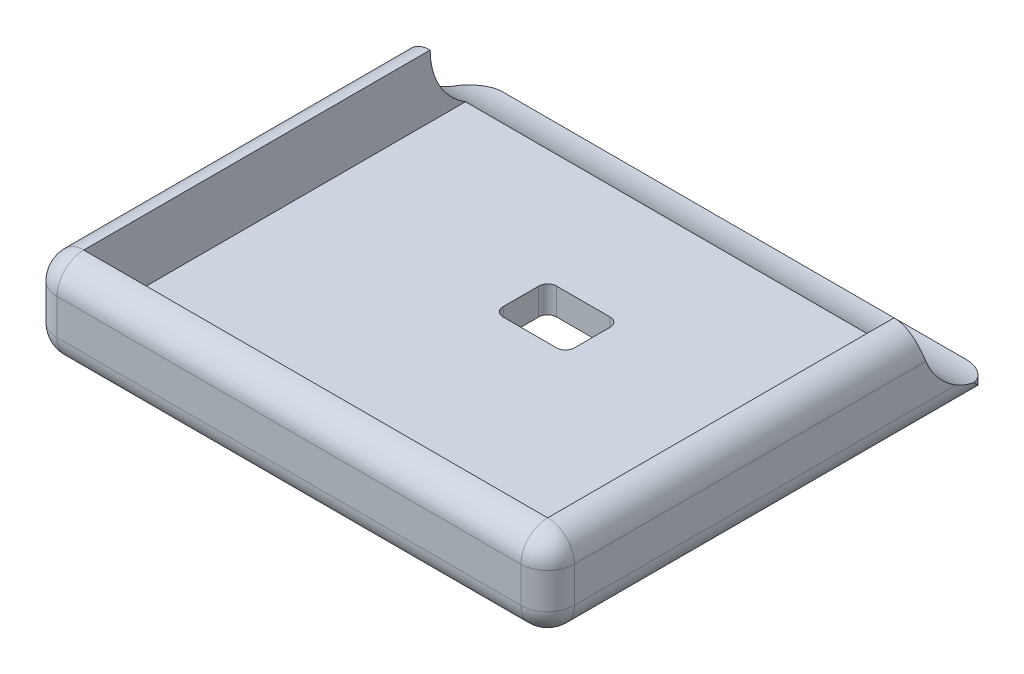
ISO-10303-21;
HEADER;
FILE_DESCRIPTION(('STEP AP214'),'2;1');
FILE_NAME('part.step','',(''),(''),'','','');
FILE_SCHEMA(('AUTOMOTIVE_DESIGN { 1 0 10303 214 1 1 1 1 }'));
ENDSEC;
DATA;
#1=APPLICATION_CONTEXT('core data for automotive mechanical design processes');
#2=APPLICATION_PROTOCOL_DEFINITION('international standard','automotive_design',2000,#1);
#3=PRODUCT_CONTEXT('',#1,'mechanical');
#4=PRODUCT('Part','Part','',(#3));
#5=PRODUCT_RELATED_PRODUCT_CATEGORY('part','',(#4));
#6=PRODUCT_DEFINITION_FORMATION('','',#4);
#7=PRODUCT_DEFINITION_CONTEXT('part definition',#1,'design');
#8=PRODUCT_DEFINITION('design','',#6,#7);
#9=PRODUCT_DEFINITION_SHAPE('','',#8);
#10=(LENGTH_UNIT() NAMED_UNIT(*) SI_UNIT(.MILLI.,.METRE.));
#11=(NAMED_UNIT(*) PLANE_ANGLE_UNIT() SI_UNIT($,.RADIAN.));
#12=(NAMED_UNIT(*) SI_UNIT($,.STERADIAN.) SOLID_ANGLE_UNIT());
#13=UNCERTAINTY_MEASURE_WITH_UNIT(LENGTH_MEASURE(1.E-05),#10,'distance_accuracy_value','');
#14=(GEOMETRIC_REPRESENTATION_CONTEXT(3) GLOBAL_UNCERTAINTY_ASSIGNED_CONTEXT((#13)) GLOBAL_UNIT_ASSIGNED_CONTEXT((#10,
#11,#12)) REPRESENTATION_CONTEXT('',''));
#15=CARTESIAN_POINT('',(0.,0.,0.));
#16=DIRECTION('',(0.,0.,1.));
#17=DIRECTION('',(1.,0.,0.));
#18=AXIS2_PLACEMENT_3D('',#15,#16,#17);
#19=CARTESIAN_POINT('',(-14.5,5.,-12.5));
#20=DIRECTION('',(0.,0.,1.));
#21=DIRECTION('',(1.,0.,0.));
#22=AXIS2_PLACEMENT_3D('',#19,#20,#21);
#23=PLANE('',#22);
#24=DIRECTION('',(1.,0.,0.));
#25=VECTOR('',#24,1.);
#26=CARTESIAN_POINT('',(-16.5,0.915253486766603,-12.5));
#27=LINE('',#26,#25);
#28=CARTESIAN_POINT('',(13.,0.915253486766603,-12.5));
#29=VERTEX_POINT('',#28);
#30=CARTESIAN_POINT('',(-13.,0.915253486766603,-12.5));
#31=VERTEX_POINT('',#30);
#32=EDGE_CURVE('E315',#29,#31,#27,.F.);
#33=ORIENTED_EDGE('',*,*,#32,.F.);
#34=DIRECTION('',(0.,-1.,0.));
#35=VECTOR('',#34,1.);
#36=CARTESIAN_POINT('',(13.,5.,-12.5));
#37=LINE('',#36,#35);
#38=CARTESIAN_POINT('',(13.,0.,-12.5));
#39=VERTEX_POINT('',#38);
#40=EDGE_CURVE('E213',#29,#39,#37,.T.);
#41=ORIENTED_EDGE('',*,*,#40,.T.);
#42=DIRECTION('',(-1.,0.,0.));
#43=VECTOR('',#42,1.);
#44=CARTESIAN_POINT('',(-14.5,0.,-12.5));
#45=LINE('',#44,#43);
#46=CARTESIAN_POINT('',(-13.,0.,-12.5));
#47=VERTEX_POINT('',#46);
#48=EDGE_CURVE('E423',#39,#47,#45,.T.);
#49=ORIENTED_EDGE('',*,*,#48,.T.);
#50=DIRECTION('',(0.,-1.,0.));
#51=VECTOR('',#50,1.);
#52=CARTESIAN_POINT('',(-13.,5.,-12.5));
#53=LINE('',#52,#51);
#54=EDGE_CURVE('E210',#47,#31,#53,.F.);
#55=ORIENTED_EDGE('',*,*,#54,.T.);
#56=EDGE_LOOP('',(#33,#41,#49,#55));
#57=FACE_BOUND('',#56,.T.);
#58=ADVANCED_FACE('F33',(#57),#23,.F.);
#59=CARTESIAN_POINT('',(0.,1.5,0.));
#60=DIRECTION('',(0.,1.,0.));
#61=DIRECTION('',(0.,0.,1.));
#62=AXIS2_PLACEMENT_3D('',#59,#60,#61);
#63=PLANE('',#62);
#64=DIRECTION('',(0.,0.,-1.));
#65=VECTOR('',#64,1.);
#66=CARTESIAN_POINT('',(1.99999999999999,1.5,0.));
#67=LINE('',#66,#65);
#68=CARTESIAN_POINT('',(2.,1.5,-1.5));
#69=VERTEX_POINT('',#68);
#70=CARTESIAN_POINT('',(2.,1.5,-3.5));
#71=VERTEX_POINT('',#70);
#72=EDGE_CURVE('E192',#69,#71,#67,.T.);
#73=ORIENTED_EDGE('',*,*,#72,.F.);
#74=CARTESIAN_POINT('',(1.5,1.5,-1.5));
#75=DIRECTION('',(0.,1.,0.));
#76=DIRECTION('',(0.,0.,1.));
#77=AXIS2_PLACEMENT_3D('',#74,#75,#76);
#78=CIRCLE('',#77,0.5);
#79=CARTESIAN_POINT('',(1.5,1.5,-0.999999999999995));
#80=VERTEX_POINT('',#79);
#81=EDGE_CURVE('E616',#69,#80,#78,.F.);
#82=ORIENTED_EDGE('',*,*,#81,.T.);
#83=DIRECTION('',(1.,0.,0.));
#84=VECTOR('',#83,1.);
#85=CARTESIAN_POINT('',(0.,1.5,-0.999999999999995));
#86=LINE('',#85,#84);
#87=CARTESIAN_POINT('',(-1.5,1.5,-0.999999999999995));
#88=VERTEX_POINT('',#87);
#89=EDGE_CURVE('E608',#88,#80,#86,.T.);
#90=ORIENTED_EDGE('',*,*,#89,.F.);
#91=CARTESIAN_POINT('',(-1.5,1.5,-1.5));
#92=DIRECTION('',(0.,1.,0.));
#93=DIRECTION('',(0.,0.,1.));
#94=AXIS2_PLACEMENT_3D('',#91,#92,#93);
#95=CIRCLE('',#94,0.5);
#96=CARTESIAN_POINT('',(-2.,1.5,-1.5));
#97=VERTEX_POINT('',#96);
#98=EDGE_CURVE('E11',#88,#97,#95,.F.);
#99=ORIENTED_EDGE('',*,*,#98,.T.);
#100=DIRECTION('',(0.,0.,1.));
#101=VECTOR('',#100,1.);
#102=CARTESIAN_POINT('',(-2.,1.5,0.));
#103=LINE('',#102,#101);
#104=CARTESIAN_POINT('',(-2.,1.5,-3.49999999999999));
#105=VERTEX_POINT('',#104);
#106=EDGE_CURVE('E613',#105,#97,#103,.T.);
#107=ORIENTED_EDGE('',*,*,#106,.F.);
#108=CARTESIAN_POINT('',(-1.5,1.5,-3.49999999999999));
#109=DIRECTION('',(0.,1.,0.));
#110=DIRECTION('',(0.,0.,1.));
#111=AXIS2_PLACEMENT_3D('',#108,#109,#110);
#112=CIRCLE('',#111,0.5);
#113=CARTESIAN_POINT('',(-1.5,1.5,-3.99999999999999));
#114=VERTEX_POINT('',#113);
#115=EDGE_CURVE('E619',#105,#114,#112,.F.);
#116=ORIENTED_EDGE('',*,*,#115,.T.);
#117=DIRECTION('',(-1.,0.,0.));
#118=VECTOR('',#117,1.);
#119=CARTESIAN_POINT('',(0.,1.5,-3.99999999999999));
#120=LINE('',#119,#118);
#121=CARTESIAN_POINT('',(1.5,1.5,-3.99999999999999));
#122=VERTEX_POINT('',#121);
#123=EDGE_CURVE('E637',#122,#114,#120,.T.);
#124=ORIENTED_EDGE('',*,*,#123,.F.);
#125=CARTESIAN_POINT('',(1.5,1.5,-3.5));
#126=DIRECTION('',(0.,1.,0.));
#127=DIRECTION('',(0.,0.,1.));
#128=AXIS2_PLACEMENT_3D('',#125,#126,#127);
#129=CIRCLE('',#128,0.5);
#130=EDGE_CURVE('E628',#122,#71,#129,.F.);
#131=ORIENTED_EDGE('',*,*,#130,.T.);
#132=EDGE_LOOP('',(#73,#82,#90,#99,#107,#116,#124,#131));
#133=FACE_BOUND('',#132,.T.);
#134=DIRECTION('',(0.,0.,-1.));
#135=VECTOR('',#134,1.);
#136=CARTESIAN_POINT('',(13.,1.5,-12.5));
#137=LINE('',#136,#135);
#138=CARTESIAN_POINT('',(13.,1.5,11.));
#139=VERTEX_POINT('',#138);
#140=CARTESIAN_POINT('',(13.,1.5,-10.3940194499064));
#141=VERTEX_POINT('',#140);
#142=EDGE_CURVE('E263',#139,#141,#137,.T.);
#143=ORIENTED_EDGE('',*,*,#142,.T.);
#144=DIRECTION('',(1.,0.,0.));
#145=VECTOR('',#144,1.);
#146=CARTESIAN_POINT('',(-16.5,1.5,-10.3940194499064));
#147=LINE('',#146,#145);
#148=CARTESIAN_POINT('',(-13.,1.5,-10.3940194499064));
#149=VERTEX_POINT('',#148);
#150=EDGE_CURVE('E447',#141,#149,#147,.F.);
#151=ORIENTED_EDGE('',*,*,#150,.T.);
#152=DIRECTION('',(0.,0.,1.));
#153=VECTOR('',#152,1.);
#154=CARTESIAN_POINT('',(-13.,1.5,-12.5));
#155=LINE('',#154,#153);
#156=CARTESIAN_POINT('',(-13.,1.5,11.));
#157=VERTEX_POINT('',#156);
#158=EDGE_CURVE('E438',#149,#157,#155,.T.);
#159=ORIENTED_EDGE('',*,*,#158,.T.);
#160=DIRECTION('',(1.,0.,0.));
#161=VECTOR('',#160,1.);
#162=CARTESIAN_POINT('',(-14.5,1.5,11.));
#163=LINE('',#162,#161);
#164=EDGE_CURVE('E436',#157,#139,#163,.T.);
#165=ORIENTED_EDGE('',*,*,#164,.T.);
#166=EDGE_LOOP('',(#143,#151,#159,#165));
#167=FACE_BOUND('',#166,.T.);
#168=ADVANCED_FACE('F348',(#133,#167),#63,.T.);
#169=CARTESIAN_POINT('',(-13.,1.5,-12.5));
#170=DIRECTION('',(0.,0.,1.));
#171=DIRECTION('',(1.,0.,0.));
#172=AXIS2_PLACEMENT_3D('',#169,#170,#171);
#173=CYLINDRICAL_SURFACE('',#172,1.5);
#174=DIRECTION('',(0.,0.,1.));
#175=VECTOR('',#174,1.);
#176=CARTESIAN_POINT('',(-14.5,1.5,-12.5));
#177=LINE('',#176,#175);
#178=CARTESIAN_POINT('',(-14.5,1.5,-10.3940194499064));
#179=VERTEX_POINT('',#178);
#180=CARTESIAN_POINT('',(-14.5,1.5,11.));
#181=VERTEX_POINT('',#180);
#182=EDGE_CURVE('E220',#179,#181,#177,.T.);
#183=ORIENTED_EDGE('',*,*,#182,.F.);
#184=CARTESIAN_POINT('',(-14.5,1.5,-10.3940194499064));
#185=CARTESIAN_POINT('',(-14.4999525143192,1.44489301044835,-10.4855855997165));
#186=CARTESIAN_POINT('',(-14.4969661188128,1.39344153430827,-10.5792459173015));
#187=CARTESIAN_POINT('',(-14.487136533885,1.29812482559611,-10.7700809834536));
#188=CARTESIAN_POINT('',(-14.4802962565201,1.25425389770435,-10.8672530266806));
#189=CARTESIAN_POINT('',(-14.4649467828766,1.17518087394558,-11.0623783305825));
#190=CARTESIAN_POINT('',(-14.4564781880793,1.13980733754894,-11.160265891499));
#191=CARTESIAN_POINT('',(-14.4393856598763,1.07662864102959,-11.3584547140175));
#192=CARTESIAN_POINT('',(-14.4307617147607,1.04882405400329,-11.4587561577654));
#193=CARTESIAN_POINT('',(-14.4158667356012,1.00422351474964,-11.64736755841));
#194=CARTESIAN_POINT('',(-14.4094352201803,0.986440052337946,-11.7354323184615));
#195=CARTESIAN_POINT('',(-14.3982438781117,0.956707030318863,-11.9126293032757));
#196=CARTESIAN_POINT('',(-14.3934836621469,0.944756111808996,-12.0017612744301));
#197=CARTESIAN_POINT('',(-14.3861077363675,0.926584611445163,-12.1824461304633));
#198=CARTESIAN_POINT('',(-14.3835351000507,0.920478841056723,-12.274012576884));
#199=CARTESIAN_POINT('',(-14.3816259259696,0.91595311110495,-12.4115519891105));
#200=CARTESIAN_POINT('',(-14.3813147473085,0.91521728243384,-12.4574473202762));
#201=CARTESIAN_POINT('',(-14.3813456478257,0.915292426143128,-12.5492375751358));
#202=CARTESIAN_POINT('',(-14.3816877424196,0.916103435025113,-12.5951324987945));
#203=CARTESIAN_POINT('',(-14.3823575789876,0.917687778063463,-12.641));
#204=B_SPLINE_CURVE_WITH_KNOTS('',3,(#184,#185,#186,#187,#188,#189,#190,#191,#192,#193,#194,
#195,#196,#197,#198,#199,#200,#201,#202,#203),.UNSPECIFIED.,.F.,.F.,(4,2,2,2,2,2,2,2,2,4),(0.,
0.320363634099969,0.640485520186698,0.953471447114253,1.2664810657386,1.5364980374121,
1.806452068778,2.08160593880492,2.21928611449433,2.35696953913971),.UNSPECIFIED.);
#205=CARTESIAN_POINT('',(-14.4319816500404,1.0534257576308,-11.446574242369));
#206=VERTEX_POINT('',#205);
#207=EDGE_CURVE('E298',#179,#206,#204,.T.);
#208=ORIENTED_EDGE('',*,*,#207,.T.);
#209=CARTESIAN_POINT('',(-13.,1.5,-11.));
#210=DIRECTION('',(0.,-0.707106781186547,0.707106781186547));
#211=DIRECTION('',(0.,-0.707106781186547,-0.707106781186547));
#212=AXIS2_PLACEMENT_3D('',#209,#210,#211);
#213=ELLIPSE('',#212,2.12132034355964,1.5);
#214=EDGE_CURVE('E260',#47,#206,#213,.F.);
#215=ORIENTED_EDGE('',*,*,#214,.F.);
#216=DIRECTION('',(0.,0.,1.));
#217=VECTOR('',#216,1.);
#218=CARTESIAN_POINT('',(-13.,0.,0.));
#219=LINE('',#218,#217);
#220=CARTESIAN_POINT('',(-13.,0.,11.));
#221=VERTEX_POINT('',#220);
#222=EDGE_CURVE('E411',#221,#47,#219,.F.);
#223=ORIENTED_EDGE('',*,*,#222,.F.);
#224=CARTESIAN_POINT('',(-13.,1.5,11.));
#225=DIRECTION('',(0.,0.,1.));
#226=DIRECTION('',(1.,0.,0.));
#227=AXIS2_PLACEMENT_3D('',#224,#225,#226);
#228=CIRCLE('',#227,1.5);
#229=EDGE_CURVE('E253',#181,#221,#228,.T.);
#230=ORIENTED_EDGE('',*,*,#229,.F.);
#231=EDGE_LOOP('',(#183,#208,#215,#223,#230));
#232=FACE_BOUND('',#231,.T.);
#233=ADVANCED_FACE('F332',(#232),#173,.T.);
#234=CARTESIAN_POINT('',(-13.,5.,-11.));
#235=DIRECTION('',(0.,-1.,0.));
#236=DIRECTION('',(0.,0.,-1.));
#237=AXIS2_PLACEMENT_3D('',#234,#235,#236);
#238=CYLINDRICAL_SURFACE('',#237,1.5);
#239=ORIENTED_EDGE('',*,*,#214,.T.);
#240=CARTESIAN_POINT('',(-14.5,1.20063767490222,-11.));
#241=CARTESIAN_POINT('',(-14.4999996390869,1.18523406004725,-11.039008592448));
#242=CARTESIAN_POINT('',(-14.4984768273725,1.17044182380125,-11.0782446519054));
#243=CARTESIAN_POINT('',(-14.4922899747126,1.1421374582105,-11.1569445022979));
#244=CARTESIAN_POINT('',(-14.4876248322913,1.12862577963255,-11.196408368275));
#245=CARTESIAN_POINT('',(-14.4687812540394,1.09013039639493,-11.3147065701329));
#246=CARTESIAN_POINT('',(-14.4497549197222,1.06716561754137,-11.3935002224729));
#247=CARTESIAN_POINT('',(-14.3985463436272,1.02683347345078,-11.5484020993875));
#248=CARTESIAN_POINT('',(-14.3663314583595,1.00948018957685,-11.6245031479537));
#249=CARTESIAN_POINT('',(-14.289293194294,0.980122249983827,-11.7710819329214));
#250=CARTESIAN_POINT('',(-14.2444810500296,0.968112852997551,-11.8415646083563));
#251=CARTESIAN_POINT('',(-14.1451072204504,0.948969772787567,-11.9722367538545));
#252=CARTESIAN_POINT('',(-14.0909227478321,0.941686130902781,-12.0326920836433));
#253=CARTESIAN_POINT('',(-13.9733053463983,0.930389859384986,-12.1442237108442));
#254=CARTESIAN_POINT('',(-13.9098683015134,0.92637869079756,-12.195295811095));
#255=CARTESIAN_POINT('',(-13.7746902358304,0.920542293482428,-12.2870948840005));
#256=CARTESIAN_POINT('',(-13.7028576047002,0.918744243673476,-12.3276884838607));
#257=CARTESIAN_POINT('',(-13.5535074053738,0.916417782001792,-12.3965631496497));
#258=CARTESIAN_POINT('',(-13.4759913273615,0.9158890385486,-12.4248474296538));
#259=CARTESIAN_POINT('',(-13.3321441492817,0.915369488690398,-12.4642960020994));
#260=CARTESIAN_POINT('',(-13.266407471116,0.915297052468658,-12.477663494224));
#261=CARTESIAN_POINT('',(-13.1337877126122,0.915253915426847,-12.495523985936));
#262=CARTESIAN_POINT('',(-13.0669054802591,0.91528314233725,-12.5000232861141));
#263=CARTESIAN_POINT('',(-13.,0.915253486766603,-12.5));
#264=B_SPLINE_CURVE_WITH_KNOTS('',3,(#240,#241,#242,#243,#244,#245,#246,#247,#248,#249,#250,
#251,#252,#253,#254,#255,#256,#257,#258,#259,#260,#261,#262,#263),.UNSPECIFIED.,.F.,.F.,(4,2,2,
2,2,2,2,2,2,2,2,4),(0.,0.12575650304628,0.251557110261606,0.502990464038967,0.755049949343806,
1.00688535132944,1.25027809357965,1.49377944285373,1.74024227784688,1.98664072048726,
2.1873057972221,2.38782825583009),.UNSPECIFIED.);
#265=EDGE_CURVE('E304',#206,#31,#264,.T.);
#266=ORIENTED_EDGE('',*,*,#265,.T.);
#267=ORIENTED_EDGE('',*,*,#54,.F.);
#268=EDGE_LOOP('',(#239,#266,#267));
#269=FACE_BOUND('',#268,.T.);
#270=ADVANCED_FACE('F325',(#269),#238,.T.);
#271=CARTESIAN_POINT('',(13.,5.,-11.));
#272=DIRECTION('',(0.,-1.,0.));
#273=DIRECTION('',(0.,0.,-1.));
#274=AXIS2_PLACEMENT_3D('',#271,#272,#273);
#275=CYLINDRICAL_SURFACE('',#274,1.5);
#276=ORIENTED_EDGE('',*,*,#40,.F.);
#277=CARTESIAN_POINT('',(13.,0.915253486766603,-12.5));
#278=CARTESIAN_POINT('',(13.0421457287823,0.915257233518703,-12.4999997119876));
#279=CARTESIAN_POINT('',(13.0842712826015,0.915253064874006,-12.4982226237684));
#280=CARTESIAN_POINT('',(13.1682219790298,0.915260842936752,-12.49113301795));
#281=CARTESIAN_POINT('',(13.2100471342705,0.91527278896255,-12.4858206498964));
#282=CARTESIAN_POINT('',(13.3345701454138,0.915380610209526,-12.46462759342));
#283=CARTESIAN_POINT('',(13.4164358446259,0.915548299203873,-12.4434908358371));
#284=CARTESIAN_POINT('',(13.5754636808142,0.916701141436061,-12.387787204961));
#285=CARTESIAN_POINT('',(13.6526231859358,0.917686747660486,-12.3532128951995));
#286=CARTESIAN_POINT('',(13.8000227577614,0.921438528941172,-12.2716337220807));
#287=CARTESIAN_POINT('',(13.8702639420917,0.924204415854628,-12.2246308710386));
#288=CARTESIAN_POINT('',(14.0014043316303,0.932639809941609,-12.1199070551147));
#289=CARTESIAN_POINT('',(14.062353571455,0.938292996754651,-12.0622474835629));
#290=CARTESIAN_POINT('',(14.1735823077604,0.953630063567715,-11.9379001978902));
#291=CARTESIAN_POINT('',(14.2238655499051,0.963312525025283,-11.8712156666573));
#292=CARTESIAN_POINT('',(14.3113762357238,0.987366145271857,-11.7327021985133));
#293=CARTESIAN_POINT('',(14.3488746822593,1.00162562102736,-11.661024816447));
#294=CARTESIAN_POINT('',(14.411599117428,1.03541730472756,-11.5136174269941));
#295=CARTESIAN_POINT('',(14.4368213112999,1.05495114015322,-11.437886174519));
#296=CARTESIAN_POINT('',(14.4707264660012,1.09458479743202,-11.3013346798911));
#297=CARTESIAN_POINT('',(14.4817939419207,1.11366862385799,-11.2407922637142));
#298=CARTESIAN_POINT('',(14.496435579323,1.15489966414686,-11.1199692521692));
#299=CARTESIAN_POINT('',(14.5000239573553,1.17704098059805,-11.0596883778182));
#300=CARTESIAN_POINT('',(14.5,1.20063767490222,-11.));
#301=B_SPLINE_CURVE_WITH_KNOTS('',3,(#277,#278,#279,#280,#281,#282,#283,#284,#285,#286,#287,
#288,#289,#290,#291,#292,#293,#294,#295,#296,#297,#298,#299,#300),.UNSPECIFIED.,.F.,.F.,(4,2,2,
2,2,2,2,2,2,2,2,4),(0.,0.12635965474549,0.252713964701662,0.505066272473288,0.757558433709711,
1.01000973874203,1.26104960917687,1.51200117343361,1.75724339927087,2.00256138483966,
2.19537300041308,2.3878177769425),.UNSPECIFIED.);
#302=CARTESIAN_POINT('',(14.4319816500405,1.05342575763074,-11.4465742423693));
#303=VERTEX_POINT('',#302);
#304=EDGE_CURVE('E205',#29,#303,#301,.T.);
#305=ORIENTED_EDGE('',*,*,#304,.T.);
#306=CARTESIAN_POINT('',(13.,1.5,-11.));
#307=DIRECTION('',(0.,-0.707106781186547,0.707106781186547));
#308=DIRECTION('',(0.,-0.707106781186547,-0.707106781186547));
#309=AXIS2_PLACEMENT_3D('',#306,#307,#308);
#310=ELLIPSE('',#309,2.12132034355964,1.5);
#311=EDGE_CURVE('E203',#39,#303,#310,.T.);
#312=ORIENTED_EDGE('',*,*,#311,.F.);
#313=EDGE_LOOP('',(#276,#305,#312));
#314=FACE_BOUND('',#313,.T.);
#315=ADVANCED_FACE('F321',(#314),#275,.T.);
#316=CARTESIAN_POINT('',(13.,1.5,-12.5));
#317=DIRECTION('',(0.,0.,-1.));
#318=DIRECTION('',(-1.,0.,0.));
#319=AXIS2_PLACEMENT_3D('',#316,#317,#318);
#320=CYLINDRICAL_SURFACE('',#319,1.5);
#321=ORIENTED_EDGE('',*,*,#311,.T.);
#322=CARTESIAN_POINT('',(14.3823575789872,0.917687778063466,-12.641));
#323=CARTESIAN_POINT('',(14.3815655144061,0.915818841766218,-12.5868982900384));
#324=CARTESIAN_POINT('',(14.3812324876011,0.915026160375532,-12.5327591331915));
#325=CARTESIAN_POINT('',(14.3814740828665,0.91559263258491,-12.4244974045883));
#326=CARTESIAN_POINT('',(14.3820486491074,0.916951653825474,-12.3703748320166));
#327=CARTESIAN_POINT('',(14.3851160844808,0.924250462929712,-12.2082624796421));
#328=CARTESIAN_POINT('',(14.388951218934,0.933408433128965,-12.1004243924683));
#329=CARTESIAN_POINT('',(14.3994696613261,0.959925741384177,-11.8883431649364));
#330=CARTESIAN_POINT('',(14.4060882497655,0.977099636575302,-11.784073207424));
#331=CARTESIAN_POINT('',(14.4211090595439,1.01942870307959,-11.5773122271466));
#332=CARTESIAN_POINT('',(14.4295114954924,1.04458483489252,-11.4748214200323));
#333=CARTESIAN_POINT('',(14.452584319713,1.12237157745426,-11.2037422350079));
#334=CARTESIAN_POINT('',(14.4676639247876,1.18209424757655,-11.0371398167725));
#335=CARTESIAN_POINT('',(14.4854180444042,1.28823790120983,-10.7923394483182));
#336=CARTESIAN_POINT('',(14.4905498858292,1.32682674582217,-10.710842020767));
#337=CARTESIAN_POINT('',(14.4978317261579,1.40940190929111,-10.5504092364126));
#338=CARTESIAN_POINT('',(14.4999791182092,1.45339291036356,-10.4714761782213));
#339=CARTESIAN_POINT('',(14.5,1.5,-10.3940194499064));
#340=B_SPLINE_CURVE_WITH_KNOTS('',3,(#322,#323,#324,#325,#326,#327,#328,#329,#330,#331,#332,
#333,#334,#335,#336,#337,#338,#339),.UNSPECIFIED.,.F.,.F.,(4,2,2,2,2,2,2,2,4),(0.,
0.162393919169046,0.324777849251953,0.649235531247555,0.966533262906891,1.2838691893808,
1.81498647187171,2.0857324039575,2.35671467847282),.UNSPECIFIED.);
#341=CARTESIAN_POINT('',(14.5,1.5,-10.3940194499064));
#342=VERTEX_POINT('',#341);
#343=EDGE_CURVE('E184',#303,#342,#340,.T.);
#344=ORIENTED_EDGE('',*,*,#343,.T.);
#345=DIRECTION('',(0.,0.,-1.));
#346=VECTOR('',#345,1.);
#347=CARTESIAN_POINT('',(14.5,1.5,-12.5));
#348=LINE('',#347,#346);
#349=CARTESIAN_POINT('',(14.5,1.5,11.));
#350=VERTEX_POINT('',#349);
#351=EDGE_CURVE('E199',#350,#342,#348,.T.);
#352=ORIENTED_EDGE('',*,*,#351,.F.);
#353=CARTESIAN_POINT('',(13.,1.5,11.));
#354=DIRECTION('',(0.,0.,1.));
#355=DIRECTION('',(1.,0.,0.));
#356=AXIS2_PLACEMENT_3D('',#353,#354,#355);
#357=CIRCLE('',#356,1.5);
#358=CARTESIAN_POINT('',(13.,0.,11.));
#359=VERTEX_POINT('',#358);
#360=EDGE_CURVE('E251',#359,#350,#357,.T.);
#361=ORIENTED_EDGE('',*,*,#360,.F.);
#362=DIRECTION('',(0.,0.,-1.));
#363=VECTOR('',#362,1.);
#364=CARTESIAN_POINT('',(13.,0.,0.));
#365=LINE('',#364,#363);
#366=EDGE_CURVE('E405',#39,#359,#365,.F.);
#367=ORIENTED_EDGE('',*,*,#366,.F.);
#368=EDGE_LOOP('',(#321,#344,#352,#361,#367));
#369=FACE_BOUND('',#368,.T.);
#370=ADVANCED_FACE('F197',(#369),#320,.T.);
#371=CARTESIAN_POINT('',(-13.,3.5,0.));
#372=DIRECTION('',(0.,0.,-1.));
#373=DIRECTION('',(-1.,0.,0.));
#374=AXIS2_PLACEMENT_3D('',#371,#372,#373);
#375=CYLINDRICAL_SURFACE('',#374,1.5);
#376=DIRECTION('',(0.,0.,1.));
#377=VECTOR('',#376,1.);
#378=CARTESIAN_POINT('',(-13.,5.,-12.5));
#379=LINE('',#378,#377);
#380=CARTESIAN_POINT('',(-13.,5.,-8.4152534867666));
#381=VERTEX_POINT('',#380);
#382=CARTESIAN_POINT('',(-13.,5.,11.));
#383=VERTEX_POINT('',#382);
#384=EDGE_CURVE('E431',#381,#383,#379,.T.);
#385=ORIENTED_EDGE('',*,*,#384,.F.);
#386=CARTESIAN_POINT('',(-13.,5.,-8.4152534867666));
#387=CARTESIAN_POINT('',(-13.0421457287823,4.99999971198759,-8.4152572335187));
#388=CARTESIAN_POINT('',(-13.0842712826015,4.99822262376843,-8.41525306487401));
#389=CARTESIAN_POINT('',(-13.1682219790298,4.99113301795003,-8.41526084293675));
#390=CARTESIAN_POINT('',(-13.2100471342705,4.98582064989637,-8.41527278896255));
#391=CARTESIAN_POINT('',(-13.3345701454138,4.96462759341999,-8.41538061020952));
#392=CARTESIAN_POINT('',(-13.4164358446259,4.94349083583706,-8.41554829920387));
#393=CARTESIAN_POINT('',(-13.5754636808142,4.88778720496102,-8.41670114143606));
#394=CARTESIAN_POINT('',(-13.6526231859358,4.85321289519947,-8.41768674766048));
#395=CARTESIAN_POINT('',(-13.8000227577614,4.77163372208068,-8.42143852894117));
#396=CARTESIAN_POINT('',(-13.8702639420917,4.7246308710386,-8.42420441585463));
#397=CARTESIAN_POINT('',(-14.0014043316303,4.61990705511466,-8.43263980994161));
#398=CARTESIAN_POINT('',(-14.062353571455,4.56224748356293,-8.43829299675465));
#399=CARTESIAN_POINT('',(-14.1735823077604,4.4379001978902,-8.45363006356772));
#400=CARTESIAN_POINT('',(-14.2238655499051,4.37121566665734,-8.46331252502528));
#401=CARTESIAN_POINT('',(-14.3113762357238,4.23270219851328,-8.48736614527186));
#402=CARTESIAN_POINT('',(-14.3488746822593,4.16102481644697,-8.50162562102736));
#403=CARTESIAN_POINT('',(-14.411599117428,4.01361742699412,-8.53541730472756));
#404=CARTESIAN_POINT('',(-14.4368213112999,3.93788617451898,-8.55495114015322));
#405=CARTESIAN_POINT('',(-14.4707264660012,3.80133467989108,-8.59458479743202));
#406=CARTESIAN_POINT('',(-14.4817939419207,3.74079226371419,-8.613668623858));
#407=CARTESIAN_POINT('',(-14.496435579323,3.61996925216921,-8.65489966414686));
#408=CARTESIAN_POINT('',(-14.5000239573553,3.55968837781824,-8.67704098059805));
#409=CARTESIAN_POINT('',(-14.5,3.5,-8.70063767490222));
#410=B_SPLINE_CURVE_WITH_KNOTS('',3,(#386,#387,#388,#389,#390,#391,#392,#393,#394,#395,#396,
#397,#398,#399,#400,#401,#402,#403,#404,#405,#406,#407,#408,#409),.UNSPECIFIED.,.F.,.F.,(4,2,2,
2,2,2,2,2,2,2,2,4),(0.,0.126359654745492,0.252713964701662,0.505066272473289,0.75755843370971,
1.01000973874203,1.26104960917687,1.51200117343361,1.75724339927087,2.00256138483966,
2.19537300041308,2.38781777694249),.UNSPECIFIED.);
#411=CARTESIAN_POINT('',(-14.5,3.5,-8.70063767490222));
#412=VERTEX_POINT('',#411);
#413=EDGE_CURVE('E290',#381,#412,#410,.T.);
#414=ORIENTED_EDGE('',*,*,#413,.T.);
#415=DIRECTION('',(0.,0.,1.));
#416=VECTOR('',#415,1.);
#417=CARTESIAN_POINT('',(-14.5,3.5,-8.5));
#418=LINE('',#417,#416);
#419=CARTESIAN_POINT('',(-14.5,3.5,11.));
#420=VERTEX_POINT('',#419);
#421=EDGE_CURVE('E224',#420,#412,#418,.F.);
#422=ORIENTED_EDGE('',*,*,#421,.F.);
#423=CARTESIAN_POINT('',(-13.,3.5,11.));
#424=DIRECTION('',(0.,0.,1.));
#425=DIRECTION('',(1.,0.,0.));
#426=AXIS2_PLACEMENT_3D('',#423,#424,#425);
#427=CIRCLE('',#426,1.5);
#428=EDGE_CURVE('E236',#383,#420,#427,.T.);
#429=ORIENTED_EDGE('',*,*,#428,.F.);
#430=EDGE_LOOP('',(#385,#414,#422,#429));
#431=FACE_BOUND('',#430,.T.);
#432=ADVANCED_FACE('F344',(#431),#375,.T.);
#433=CARTESIAN_POINT('',(13.,3.5,0.));
#434=DIRECTION('',(0.,0.,1.));
#435=DIRECTION('',(1.,0.,0.));
#436=AXIS2_PLACEMENT_3D('',#433,#434,#435);
#437=CYLINDRICAL_SURFACE('',#436,1.5);
#438=DIRECTION('',(0.,0.,-1.));
#439=VECTOR('',#438,1.);
#440=CARTESIAN_POINT('',(14.5,3.5,12.5));
#441=LINE('',#440,#439);
#442=CARTESIAN_POINT('',(14.5,3.5,-8.70063767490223));
#443=VERTEX_POINT('',#442);
#444=CARTESIAN_POINT('',(14.5,3.5,11.));
#445=VERTEX_POINT('',#444);
#446=EDGE_CURVE('E215',#443,#445,#441,.F.);
#447=ORIENTED_EDGE('',*,*,#446,.F.);
#448=CARTESIAN_POINT('',(14.5,3.5,-8.70063767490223));
#449=CARTESIAN_POINT('',(14.4999996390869,3.53900859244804,-8.68523406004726));
#450=CARTESIAN_POINT('',(14.4984768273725,3.57824465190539,-8.67044182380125));
#451=CARTESIAN_POINT('',(14.4922899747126,3.65694450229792,-8.6421374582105));
#452=CARTESIAN_POINT('',(14.4876248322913,3.69640836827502,-8.62862577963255));
#453=CARTESIAN_POINT('',(14.4687812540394,3.8147065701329,-8.59013039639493));
#454=CARTESIAN_POINT('',(14.4497549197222,3.89350022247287,-8.56716561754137));
#455=CARTESIAN_POINT('',(14.3985463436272,4.04840209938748,-8.52683347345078));
#456=CARTESIAN_POINT('',(14.3663314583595,4.12450314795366,-8.50948018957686));
#457=CARTESIAN_POINT('',(14.289293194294,4.2710819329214,-8.48012224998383));
#458=CARTESIAN_POINT('',(14.2444810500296,4.34156460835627,-8.46811285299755));
#459=CARTESIAN_POINT('',(14.1451072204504,4.47223675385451,-8.44896977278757));
#460=CARTESIAN_POINT('',(14.0909227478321,4.53269208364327,-8.44168613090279));
#461=CARTESIAN_POINT('',(13.9733053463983,4.64422371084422,-8.43038985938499));
#462=CARTESIAN_POINT('',(13.9098683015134,4.69529581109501,-8.42637869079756));
#463=CARTESIAN_POINT('',(13.7746902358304,4.7870948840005,-8.42054229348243));
#464=CARTESIAN_POINT('',(13.7028576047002,4.82768848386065,-8.41874424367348));
#465=CARTESIAN_POINT('',(13.5535074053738,4.89656314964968,-8.4164177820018));
#466=CARTESIAN_POINT('',(13.4759913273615,4.92484742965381,-8.4158890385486));
#467=CARTESIAN_POINT('',(13.3321441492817,4.96429600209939,-8.4153694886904));
#468=CARTESIAN_POINT('',(13.266407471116,4.97766349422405,-8.41529705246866));
#469=CARTESIAN_POINT('',(13.1337877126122,4.99552398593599,-8.41525391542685));
#470=CARTESIAN_POINT('',(13.0669054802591,5.00002328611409,-8.41528314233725));
#471=CARTESIAN_POINT('',(13.,5.,-8.41525348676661));
#472=B_SPLINE_CURVE_WITH_KNOTS('',3,(#448,#449,#450,#451,#452,#453,#454,#455,#456,#457,#458,
#459,#460,#461,#462,#463,#464,#465,#466,#467,#468,#469,#470,#471),.UNSPECIFIED.,.F.,.F.,(4,2,2,
2,2,2,2,2,2,2,2,4),(0.,0.125756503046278,0.251557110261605,0.502990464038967,0.755049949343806,
1.00688535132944,1.25027809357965,1.49377944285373,1.74024227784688,1.98664072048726,
2.1873057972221,2.38782825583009),.UNSPECIFIED.);
#473=CARTESIAN_POINT('',(13.,5.,-8.41525348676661));
#474=VERTEX_POINT('',#473);
#475=EDGE_CURVE('E187',#443,#474,#472,.T.);
#476=ORIENTED_EDGE('',*,*,#475,.T.);
#477=DIRECTION('',(0.,0.,-1.));
#478=VECTOR('',#477,1.);
#479=CARTESIAN_POINT('',(13.,5.,-12.5));
#480=LINE('',#479,#478);
#481=CARTESIAN_POINT('',(13.,5.,11.));
#482=VERTEX_POINT('',#481);
#483=EDGE_CURVE('E433',#482,#474,#480,.T.);
#484=ORIENTED_EDGE('',*,*,#483,.F.);
#485=CARTESIAN_POINT('',(13.,3.5,11.));
#486=DIRECTION('',(0.,0.,1.));
#487=DIRECTION('',(0.,-1.,0.));
#488=AXIS2_PLACEMENT_3D('',#485,#486,#487);
#489=CIRCLE('',#488,1.5);
#490=EDGE_CURVE('E233',#445,#482,#489,.T.);
#491=ORIENTED_EDGE('',*,*,#490,.F.);
#492=EDGE_LOOP('',(#447,#476,#484,#491));
#493=FACE_BOUND('',#492,.T.);
#494=ADVANCED_FACE('F272',(#493),#437,.T.);
#495=CARTESIAN_POINT('',(14.5,5.,-12.5));
#496=DIRECTION('',(-1.,0.,0.));
#497=DIRECTION('',(0.,0.,1.));
#498=AXIS2_PLACEMENT_3D('',#495,#496,#497);
#499=PLANE('',#498);
#500=CARTESIAN_POINT('',(14.5,5.,-12.5));
#501=DIRECTION('',(-1.,0.,0.));
#502=DIRECTION('',(0.,0.,1.));
#503=AXIS2_PLACEMENT_3D('',#500,#501,#502);
#504=CIRCLE('',#503,4.0847465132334);
#505=EDGE_CURVE('E181',#342,#443,#504,.T.);
#506=ORIENTED_EDGE('',*,*,#505,.T.);
#507=ORIENTED_EDGE('',*,*,#446,.T.);
#508=DIRECTION('',(0.,-1.,0.));
#509=VECTOR('',#508,1.);
#510=CARTESIAN_POINT('',(14.5,5.,11.));
#511=LINE('',#510,#509);
#512=EDGE_CURVE('E209',#445,#350,#511,.T.);
#513=ORIENTED_EDGE('',*,*,#512,.T.);
#514=ORIENTED_EDGE('',*,*,#351,.T.);
#515=EDGE_LOOP('',(#506,#507,#513,#514));
#516=FACE_BOUND('',#515,.T.);
#517=ADVANCED_FACE('F207',(#516),#499,.F.);
#518=CARTESIAN_POINT('',(-14.5,5.,-12.5));
#519=DIRECTION('',(1.,0.,0.));
#520=DIRECTION('',(0.,0.,-1.));
#521=AXIS2_PLACEMENT_3D('',#518,#519,#520);
#522=PLANE('',#521);
#523=CARTESIAN_POINT('',(-14.5,5.,-12.5));
#524=DIRECTION('',(1.,0.,0.));
#525=DIRECTION('',(0.,0.,-1.));
#526=AXIS2_PLACEMENT_3D('',#523,#524,#525);
#527=CIRCLE('',#526,4.0847465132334);
#528=EDGE_CURVE('E462',#179,#412,#527,.F.);
#529=ORIENTED_EDGE('',*,*,#528,.F.);
#530=ORIENTED_EDGE('',*,*,#182,.T.);
#531=DIRECTION('',(0.,-1.,0.));
#532=VECTOR('',#531,1.);
#533=CARTESIAN_POINT('',(-14.5,5.,11.));
#534=LINE('',#533,#532);
#535=EDGE_CURVE('E222',#181,#420,#534,.F.);
#536=ORIENTED_EDGE('',*,*,#535,.T.);
#537=ORIENTED_EDGE('',*,*,#421,.T.);
#538=EDGE_LOOP('',(#529,#530,#536,#537));
#539=FACE_BOUND('',#538,.T.);
#540=ADVANCED_FACE('F376',(#539),#522,.F.);
#541=CARTESIAN_POINT('',(-14.5,5.,12.5));
#542=DIRECTION('',(0.,0.,-1.));
#543=DIRECTION('',(-1.,0.,0.));
#544=AXIS2_PLACEMENT_3D('',#541,#542,#543);
#545=PLANE('',#544);
#546=DIRECTION('',(1.,0.,0.));
#547=VECTOR('',#546,1.);
#548=CARTESIAN_POINT('',(-14.5,1.5,12.5));
#549=LINE('',#548,#547);
#550=CARTESIAN_POINT('',(-13.,1.5,12.5));
#551=VERTEX_POINT('',#550);
#552=CARTESIAN_POINT('',(13.,1.5,12.5));
#553=VERTEX_POINT('',#552);
#554=EDGE_CURVE('E419',#551,#553,#549,.T.);
#555=ORIENTED_EDGE('',*,*,#554,.T.);
#556=DIRECTION('',(0.,-1.,0.));
#557=VECTOR('',#556,1.);
#558=CARTESIAN_POINT('',(13.,5.,12.5));
#559=LINE('',#558,#557);
#560=CARTESIAN_POINT('',(13.,3.5,12.5));
#561=VERTEX_POINT('',#560);
#562=EDGE_CURVE('E402',#553,#561,#559,.F.);
#563=ORIENTED_EDGE('',*,*,#562,.T.);
#564=DIRECTION('',(1.,0.,0.));
#565=VECTOR('',#564,1.);
#566=CARTESIAN_POINT('',(-14.5,3.5,12.5));
#567=LINE('',#566,#565);
#568=CARTESIAN_POINT('',(-13.,3.5,12.5));
#569=VERTEX_POINT('',#568);
#570=EDGE_CURVE('E416',#561,#569,#567,.F.);
#571=ORIENTED_EDGE('',*,*,#570,.T.);
#572=DIRECTION('',(0.,-1.,0.));
#573=VECTOR('',#572,1.);
#574=CARTESIAN_POINT('',(-13.,5.,12.5));
#575=LINE('',#574,#573);
#576=EDGE_CURVE('E421',#569,#551,#575,.T.);
#577=ORIENTED_EDGE('',*,*,#576,.T.);
#578=EDGE_LOOP('',(#555,#563,#571,#577));
#579=FACE_BOUND('',#578,.T.);
#580=ADVANCED_FACE('F498',(#579),#545,.F.);
#581=CARTESIAN_POINT('',(0.,0.,0.));
#582=DIRECTION('',(0.,1.,0.));
#583=DIRECTION('',(0.,0.,1.));
#584=AXIS2_PLACEMENT_3D('',#581,#582,#583);
#585=PLANE('',#584);
#586=DIRECTION('',(-1.,0.,0.));
#587=VECTOR('',#586,1.);
#588=CARTESIAN_POINT('',(-2.,0.,-0.999999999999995));
#589=LINE('',#588,#587);
#590=CARTESIAN_POINT('',(1.5,0.,-0.999999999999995));
#591=VERTEX_POINT('',#590);
#592=CARTESIAN_POINT('',(-1.5,0.,-0.999999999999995));
#593=VERTEX_POINT('',#592);
#594=EDGE_CURVE('E648',#591,#593,#589,.T.);
#595=ORIENTED_EDGE('',*,*,#594,.F.);
#596=CARTESIAN_POINT('',(1.5,0.,-1.5));
#597=DIRECTION('',(0.,1.,0.));
#598=DIRECTION('',(0.,0.,1.));
#599=AXIS2_PLACEMENT_3D('',#596,#597,#598);
#600=CIRCLE('',#599,0.5);
#601=CARTESIAN_POINT('',(2.,0.,-1.5));
#602=VERTEX_POINT('',#601);
#603=EDGE_CURVE('E55',#591,#602,#600,.T.);
#604=ORIENTED_EDGE('',*,*,#603,.T.);
#605=DIRECTION('',(0.,0.,1.));
#606=VECTOR('',#605,1.);
#607=CARTESIAN_POINT('',(2.,0.,-0.999999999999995));
#608=LINE('',#607,#606);
#609=CARTESIAN_POINT('',(2.,0.,-3.5));
#610=VERTEX_POINT('',#609);
#611=EDGE_CURVE('E650',#610,#602,#608,.T.);
#612=ORIENTED_EDGE('',*,*,#611,.F.);
#613=CARTESIAN_POINT('',(1.5,0.,-3.5));
#614=DIRECTION('',(0.,1.,0.));
#615=DIRECTION('',(0.,0.,1.));
#616=AXIS2_PLACEMENT_3D('',#613,#614,#615);
#617=CIRCLE('',#616,0.5);
#618=CARTESIAN_POINT('',(1.5,0.,-3.99999999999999));
#619=VERTEX_POINT('',#618);
#620=EDGE_CURVE('E626',#610,#619,#617,.T.);
#621=ORIENTED_EDGE('',*,*,#620,.T.);
#622=DIRECTION('',(1.,0.,0.));
#623=VECTOR('',#622,1.);
#624=CARTESIAN_POINT('',(-2.,0.,-3.99999999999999));
#625=LINE('',#624,#623);
#626=CARTESIAN_POINT('',(-1.5,0.,-3.99999999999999));
#627=VERTEX_POINT('',#626);
#628=EDGE_CURVE('E614',#627,#619,#625,.T.);
#629=ORIENTED_EDGE('',*,*,#628,.F.);
#630=CARTESIAN_POINT('',(-1.5,0.,-3.49999999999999));
#631=DIRECTION('',(0.,1.,0.));
#632=DIRECTION('',(0.,0.,1.));
#633=AXIS2_PLACEMENT_3D('',#630,#631,#632);
#634=CIRCLE('',#633,0.5);
#635=CARTESIAN_POINT('',(-2.,0.,-3.49999999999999));
#636=VERTEX_POINT('',#635);
#637=EDGE_CURVE('E617',#627,#636,#634,.T.);
#638=ORIENTED_EDGE('',*,*,#637,.T.);
#639=DIRECTION('',(0.,0.,-1.));
#640=VECTOR('',#639,1.);
#641=CARTESIAN_POINT('',(-2.,0.,-0.999999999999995));
#642=LINE('',#641,#640);
#643=CARTESIAN_POINT('',(-2.,0.,-1.5));
#644=VERTEX_POINT('',#643);
#645=EDGE_CURVE('E645',#644,#636,#642,.T.);
#646=ORIENTED_EDGE('',*,*,#645,.F.);
#647=CARTESIAN_POINT('',(-1.5,0.,-1.5));
#648=DIRECTION('',(0.,1.,0.));
#649=DIRECTION('',(0.,0.,1.));
#650=AXIS2_PLACEMENT_3D('',#647,#648,#649);
#651=CIRCLE('',#650,0.5);
#652=EDGE_CURVE('E41',#644,#593,#651,.T.);
#653=ORIENTED_EDGE('',*,*,#652,.T.);
#654=EDGE_LOOP('',(#595,#604,#612,#621,#629,#638,#646,#653));
#655=FACE_BOUND('',#654,.T.);
#656=ORIENTED_EDGE('',*,*,#48,.F.);
#657=ORIENTED_EDGE('',*,*,#366,.T.);
#658=DIRECTION('',(1.,0.,0.));
#659=VECTOR('',#658,1.);
#660=CARTESIAN_POINT('',(0.,0.,11.));
#661=LINE('',#660,#659);
#662=EDGE_CURVE('E409',#359,#221,#661,.F.);
#663=ORIENTED_EDGE('',*,*,#662,.T.);
#664=ORIENTED_EDGE('',*,*,#222,.T.);
#665=EDGE_LOOP('',(#656,#657,#663,#664));
#666=FACE_BOUND('',#665,.T.);
#667=ADVANCED_FACE('F495',(#655,#666),#585,.F.);
#668=CARTESIAN_POINT('',(13.,5.,-12.5));
#669=DIRECTION('',(-1.,0.,0.));
#670=DIRECTION('',(0.,0.,1.));
#671=AXIS2_PLACEMENT_3D('',#668,#669,#670);
#672=PLANE('',#671);
#673=ORIENTED_EDGE('',*,*,#483,.T.);
#674=CARTESIAN_POINT('',(13.,5.,-12.5));
#675=DIRECTION('',(-1.,0.,0.));
#676=DIRECTION('',(0.,0.,1.));
#677=AXIS2_PLACEMENT_3D('',#674,#675,#676);
#678=CIRCLE('',#677,4.0847465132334);
#679=EDGE_CURVE('E191',#474,#141,#678,.F.);
#680=ORIENTED_EDGE('',*,*,#679,.T.);
#681=ORIENTED_EDGE('',*,*,#142,.F.);
#682=DIRECTION('',(0.,-1.,0.));
#683=VECTOR('',#682,1.);
#684=CARTESIAN_POINT('',(13.,5.,11.));
#685=LINE('',#684,#683);
#686=EDGE_CURVE('E430',#482,#139,#685,.T.);
#687=ORIENTED_EDGE('',*,*,#686,.F.);
#688=EDGE_LOOP('',(#673,#680,#681,#687));
#689=FACE_BOUND('',#688,.T.);
#690=ADVANCED_FACE('F283',(#689),#672,.T.);
#691=CARTESIAN_POINT('',(-13.,5.,-12.5));
#692=DIRECTION('',(1.,0.,0.));
#693=DIRECTION('',(0.,0.,-1.));
#694=AXIS2_PLACEMENT_3D('',#691,#692,#693);
#695=PLANE('',#694);
#696=ORIENTED_EDGE('',*,*,#158,.F.);
#697=CARTESIAN_POINT('',(-13.,5.,-12.5));
#698=DIRECTION('',(1.,0.,0.));
#699=DIRECTION('',(0.,0.,-1.));
#700=AXIS2_PLACEMENT_3D('',#697,#698,#699);
#701=CIRCLE('',#700,4.0847465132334);
#702=EDGE_CURVE('E455',#149,#381,#701,.F.);
#703=ORIENTED_EDGE('',*,*,#702,.T.);
#704=ORIENTED_EDGE('',*,*,#384,.T.);
#705=DIRECTION('',(0.,-1.,0.));
#706=VECTOR('',#705,1.);
#707=CARTESIAN_POINT('',(-13.,5.,11.));
#708=LINE('',#707,#706);
#709=EDGE_CURVE('E426',#383,#157,#708,.T.);
#710=ORIENTED_EDGE('',*,*,#709,.T.);
#711=EDGE_LOOP('',(#696,#703,#704,#710));
#712=FACE_BOUND('',#711,.T.);
#713=ADVANCED_FACE('F488',(#712),#695,.T.);
#714=CARTESIAN_POINT('',(-14.5,5.,11.));
#715=DIRECTION('',(0.,0.,-1.));
#716=DIRECTION('',(-1.,0.,0.));
#717=AXIS2_PLACEMENT_3D('',#714,#715,#716);
#718=PLANE('',#717);
#719=ORIENTED_EDGE('',*,*,#164,.F.);
#720=ORIENTED_EDGE('',*,*,#709,.F.);
#721=DIRECTION('',(1.,0.,0.));
#722=VECTOR('',#721,1.);
#723=CARTESIAN_POINT('',(-14.5,5.,11.));
#724=LINE('',#723,#722);
#725=EDGE_CURVE('E427',#383,#482,#724,.T.);
#726=ORIENTED_EDGE('',*,*,#725,.T.);
#727=ORIENTED_EDGE('',*,*,#686,.T.);
#728=EDGE_LOOP('',(#719,#720,#726,#727));
#729=FACE_BOUND('',#728,.T.);
#730=ADVANCED_FACE('F340',(#729),#718,.T.);
#731=CARTESIAN_POINT('',(-14.5,1.5,11.));
#732=DIRECTION('',(1.,0.,0.));
#733=DIRECTION('',(0.,0.,-1.));
#734=AXIS2_PLACEMENT_3D('',#731,#732,#733);
#735=CYLINDRICAL_SURFACE('',#734,1.5);
#736=CARTESIAN_POINT('',(-13.,1.5,11.));
#737=DIRECTION('',(-1.,0.,0.));
#738=DIRECTION('',(0.,0.,1.));
#739=AXIS2_PLACEMENT_3D('',#736,#737,#738);
#740=CIRCLE('',#739,1.5);
#741=EDGE_CURVE('E256',#221,#551,#740,.T.);
#742=ORIENTED_EDGE('',*,*,#741,.F.);
#743=ORIENTED_EDGE('',*,*,#662,.F.);
#744=CARTESIAN_POINT('',(13.,1.5,11.));
#745=DIRECTION('',(1.,0.,0.));
#746=DIRECTION('',(0.,0.,-1.));
#747=AXIS2_PLACEMENT_3D('',#744,#745,#746);
#748=CIRCLE('',#747,1.5);
#749=EDGE_CURVE('E248',#553,#359,#748,.T.);
#750=ORIENTED_EDGE('',*,*,#749,.F.);
#751=ORIENTED_EDGE('',*,*,#554,.F.);
#752=EDGE_LOOP('',(#742,#743,#750,#751));
#753=FACE_BOUND('',#752,.T.);
#754=ADVANCED_FACE('F337',(#753),#735,.T.);
#755=CARTESIAN_POINT('',(-13.,1.5,11.));
#756=DIRECTION('',(0.,0.,1.));
#757=DIRECTION('',(1.,0.,0.));
#758=AXIS2_PLACEMENT_3D('',#755,#756,#757);
#759=SPHERICAL_SURFACE('',#758,1.5);
#760=ORIENTED_EDGE('',*,*,#229,.T.);
#761=ORIENTED_EDGE('',*,*,#741,.T.);
#762=CARTESIAN_POINT('',(-13.,1.5,11.));
#763=DIRECTION('',(0.,-1.,0.));
#764=DIRECTION('',(0.,0.,-1.));
#765=AXIS2_PLACEMENT_3D('',#762,#763,#764);
#766=CIRCLE('',#765,1.5);
#767=EDGE_CURVE('E245',#181,#551,#766,.F.);
#768=ORIENTED_EDGE('',*,*,#767,.F.);
#769=EDGE_LOOP('',(#760,#761,#768));
#770=FACE_BOUND('',#769,.T.);
#771=ADVANCED_FACE('F334',(#770),#759,.T.);
#772=CARTESIAN_POINT('',(13.,1.5,11.));
#773=DIRECTION('',(0.,0.,1.));
#774=DIRECTION('',(1.,0.,0.));
#775=AXIS2_PLACEMENT_3D('',#772,#773,#774);
#776=SPHERICAL_SURFACE('',#775,1.5);
#777=ORIENTED_EDGE('',*,*,#749,.T.);
#778=ORIENTED_EDGE('',*,*,#360,.T.);
#779=CARTESIAN_POINT('',(13.,1.5,11.));
#780=DIRECTION('',(0.,-1.,0.));
#781=DIRECTION('',(0.,0.,-1.));
#782=AXIS2_PLACEMENT_3D('',#779,#780,#781);
#783=CIRCLE('',#782,1.5);
#784=EDGE_CURVE('E242',#553,#350,#783,.F.);
#785=ORIENTED_EDGE('',*,*,#784,.F.);
#786=EDGE_LOOP('',(#777,#778,#785));
#787=FACE_BOUND('',#786,.T.);
#788=ADVANCED_FACE('F327',(#787),#776,.T.);
#789=CARTESIAN_POINT('',(-13.,5.,11.));
#790=DIRECTION('',(0.,-1.,0.));
#791=DIRECTION('',(0.,0.,-1.));
#792=AXIS2_PLACEMENT_3D('',#789,#790,#791);
#793=CYLINDRICAL_SURFACE('',#792,1.5);
#794=ORIENTED_EDGE('',*,*,#767,.T.);
#795=ORIENTED_EDGE('',*,*,#576,.F.);
#796=CARTESIAN_POINT('',(-13.,3.5,11.));
#797=DIRECTION('',(0.,1.,0.));
#798=DIRECTION('',(0.,0.,1.));
#799=AXIS2_PLACEMENT_3D('',#796,#797,#798);
#800=CIRCLE('',#799,1.5);
#801=EDGE_CURVE('E239',#420,#569,#800,.T.);
#802=ORIENTED_EDGE('',*,*,#801,.F.);
#803=ORIENTED_EDGE('',*,*,#535,.F.);
#804=EDGE_LOOP('',(#794,#795,#802,#803));
#805=FACE_BOUND('',#804,.T.);
#806=ADVANCED_FACE('F392',(#805),#793,.T.);
#807=CARTESIAN_POINT('',(13.,5.,11.));
#808=DIRECTION('',(0.,-1.,0.));
#809=DIRECTION('',(0.,0.,-1.));
#810=AXIS2_PLACEMENT_3D('',#807,#808,#809);
#811=CYLINDRICAL_SURFACE('',#810,1.5);
#812=ORIENTED_EDGE('',*,*,#784,.T.);
#813=ORIENTED_EDGE('',*,*,#512,.F.);
#814=CARTESIAN_POINT('',(13.,3.5,11.));
#815=DIRECTION('',(0.,1.,0.));
#816=DIRECTION('',(0.,0.,1.));
#817=AXIS2_PLACEMENT_3D('',#814,#815,#816);
#818=CIRCLE('',#817,1.5);
#819=EDGE_CURVE('E230',#561,#445,#818,.T.);
#820=ORIENTED_EDGE('',*,*,#819,.F.);
#821=ORIENTED_EDGE('',*,*,#562,.F.);
#822=EDGE_LOOP('',(#812,#813,#820,#821));
#823=FACE_BOUND('',#822,.T.);
#824=ADVANCED_FACE('F389',(#823),#811,.T.);
#825=CARTESIAN_POINT('',(-13.,3.5,11.));
#826=DIRECTION('',(0.,0.,1.));
#827=DIRECTION('',(1.,0.,0.));
#828=AXIS2_PLACEMENT_3D('',#825,#826,#827);
#829=SPHERICAL_SURFACE('',#828,1.5);
#830=ORIENTED_EDGE('',*,*,#428,.T.);
#831=ORIENTED_EDGE('',*,*,#801,.T.);
#832=CARTESIAN_POINT('',(-13.,3.5,11.));
#833=DIRECTION('',(-1.,0.,0.));
#834=DIRECTION('',(0.,0.,1.));
#835=AXIS2_PLACEMENT_3D('',#832,#833,#834);
#836=CIRCLE('',#835,1.5);
#837=EDGE_CURVE('E228',#383,#569,#836,.F.);
#838=ORIENTED_EDGE('',*,*,#837,.F.);
#839=EDGE_LOOP('',(#830,#831,#838));
#840=FACE_BOUND('',#839,.T.);
#841=ADVANCED_FACE('F386',(#840),#829,.T.);
#842=CARTESIAN_POINT('',(13.,3.5,11.));
#843=DIRECTION('',(0.,0.,1.));
#844=DIRECTION('',(1.,0.,0.));
#845=AXIS2_PLACEMENT_3D('',#842,#843,#844);
#846=SPHERICAL_SURFACE('',#845,1.5);
#847=ORIENTED_EDGE('',*,*,#819,.T.);
#848=ORIENTED_EDGE('',*,*,#490,.T.);
#849=CARTESIAN_POINT('',(13.,3.5,11.));
#850=DIRECTION('',(1.,0.,0.));
#851=DIRECTION('',(0.,0.,-1.));
#852=AXIS2_PLACEMENT_3D('',#849,#850,#851);
#853=CIRCLE('',#852,1.5);
#854=EDGE_CURVE('E204',#561,#482,#853,.F.);
#855=ORIENTED_EDGE('',*,*,#854,.F.);
#856=EDGE_LOOP('',(#847,#848,#855));
#857=FACE_BOUND('',#856,.T.);
#858=ADVANCED_FACE('F382',(#857),#846,.T.);
#859=CARTESIAN_POINT('',(0.,3.5,11.));
#860=DIRECTION('',(-1.,0.,0.));
#861=DIRECTION('',(0.,0.,1.));
#862=AXIS2_PLACEMENT_3D('',#859,#860,#861);
#863=CYLINDRICAL_SURFACE('',#862,1.5);
#864=ORIENTED_EDGE('',*,*,#837,.T.);
#865=ORIENTED_EDGE('',*,*,#570,.F.);
#866=ORIENTED_EDGE('',*,*,#854,.T.);
#867=ORIENTED_EDGE('',*,*,#725,.F.);
#868=EDGE_LOOP('',(#864,#865,#866,#867));
#869=FACE_BOUND('',#868,.T.);
#870=ADVANCED_FACE('F281',(#869),#863,.T.);
#871=CARTESIAN_POINT('',(-16.5,5.,-12.5));
#872=DIRECTION('',(1.,0.,0.));
#873=DIRECTION('',(0.,0.,-1.));
#874=AXIS2_PLACEMENT_3D('',#871,#872,#873);
#875=CYLINDRICAL_SURFACE('',#874,4.0847465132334);
#876=ORIENTED_EDGE('',*,*,#304,.F.);
#877=ORIENTED_EDGE('',*,*,#32,.T.);
#878=ORIENTED_EDGE('',*,*,#265,.F.);
#879=ORIENTED_EDGE('',*,*,#207,.F.);
#880=ORIENTED_EDGE('',*,*,#528,.T.);
#881=ORIENTED_EDGE('',*,*,#413,.F.);
#882=ORIENTED_EDGE('',*,*,#702,.F.);
#883=ORIENTED_EDGE('',*,*,#150,.F.);
#884=ORIENTED_EDGE('',*,*,#679,.F.);
#885=ORIENTED_EDGE('',*,*,#475,.F.);
#886=ORIENTED_EDGE('',*,*,#505,.F.);
#887=ORIENTED_EDGE('',*,*,#343,.F.);
#888=EDGE_LOOP('',(#876,#877,#878,#879,#880,#881,#882,#883,#884,#885,#886,#887));
#889=FACE_BOUND('',#888,.T.);
#890=ADVANCED_FACE('F183',(#889),#875,.F.);
#891=CARTESIAN_POINT('',(2.,5.,-0.999999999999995));
#892=DIRECTION('',(1.,0.,0.));
#893=DIRECTION('',(0.,0.,-1.));
#894=AXIS2_PLACEMENT_3D('',#891,#892,#893);
#895=PLANE('',#894);
#896=ORIENTED_EDGE('',*,*,#72,.T.);
#897=DIRECTION('',(0.,-1.,0.));
#898=VECTOR('',#897,1.);
#899=CARTESIAN_POINT('',(2.,0.,-3.5));
#900=LINE('',#899,#898);
#901=EDGE_CURVE('E621',#71,#610,#900,.T.);
#902=ORIENTED_EDGE('',*,*,#901,.T.);
#903=ORIENTED_EDGE('',*,*,#611,.T.);
#904=DIRECTION('',(0.,-1.,0.));
#905=VECTOR('',#904,1.);
#906=CARTESIAN_POINT('',(2.,1.5,-1.5));
#907=LINE('',#906,#905);
#908=EDGE_CURVE('E653',#602,#69,#907,.F.);
#909=ORIENTED_EDGE('',*,*,#908,.T.);
#910=EDGE_LOOP('',(#896,#902,#903,#909));
#911=FACE_BOUND('',#910,.T.);
#912=ADVANCED_FACE('F280',(#911),#895,.F.);
#913=CARTESIAN_POINT('',(-2.,5.,-3.99999999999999));
#914=DIRECTION('',(0.,0.,-1.));
#915=DIRECTION('',(-1.,0.,0.));
#916=AXIS2_PLACEMENT_3D('',#913,#914,#915);
#917=PLANE('',#916);
#918=ORIENTED_EDGE('',*,*,#123,.T.);
#919=DIRECTION('',(0.,-1.,0.));
#920=VECTOR('',#919,1.);
#921=CARTESIAN_POINT('',(-1.5,0.,-3.99999999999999));
#922=LINE('',#921,#920);
#923=EDGE_CURVE('E660',#114,#627,#922,.T.);
#924=ORIENTED_EDGE('',*,*,#923,.T.);
#925=ORIENTED_EDGE('',*,*,#628,.T.);
#926=DIRECTION('',(0.,-1.,0.));
#927=VECTOR('',#926,1.);
#928=CARTESIAN_POINT('',(1.5,1.5,-3.99999999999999));
#929=LINE('',#928,#927);
#930=EDGE_CURVE('E270',#619,#122,#929,.F.);
#931=ORIENTED_EDGE('',*,*,#930,.T.);
#932=EDGE_LOOP('',(#918,#924,#925,#931));
#933=FACE_BOUND('',#932,.T.);
#934=ADVANCED_FACE('F553',(#933),#917,.F.);
#935=CARTESIAN_POINT('',(-2.,5.,-0.999999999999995));
#936=DIRECTION('',(-1.,0.,0.));
#937=DIRECTION('',(0.,0.,1.));
#938=AXIS2_PLACEMENT_3D('',#935,#936,#937);
#939=PLANE('',#938);
#940=ORIENTED_EDGE('',*,*,#645,.T.);
#941=DIRECTION('',(0.,-1.,0.));
#942=VECTOR('',#941,1.);
#943=CARTESIAN_POINT('',(-2.,1.5,-3.49999999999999));
#944=LINE('',#943,#942);
#945=EDGE_CURVE('E654',#636,#105,#944,.F.);
#946=ORIENTED_EDGE('',*,*,#945,.T.);
#947=ORIENTED_EDGE('',*,*,#106,.T.);
#948=DIRECTION('',(0.,-1.,0.));
#949=VECTOR('',#948,1.);
#950=CARTESIAN_POINT('',(-2.,0.,-1.5));
#951=LINE('',#950,#949);
#952=EDGE_CURVE('E656',#97,#644,#951,.T.);
#953=ORIENTED_EDGE('',*,*,#952,.T.);
#954=EDGE_LOOP('',(#940,#946,#947,#953));
#955=FACE_BOUND('',#954,.T.);
#956=ADVANCED_FACE('F562',(#955),#939,.F.);
#957=CARTESIAN_POINT('',(-2.,5.,-0.999999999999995));
#958=DIRECTION('',(0.,0.,1.));
#959=DIRECTION('',(1.,0.,0.));
#960=AXIS2_PLACEMENT_3D('',#957,#958,#959);
#961=PLANE('',#960);
#962=ORIENTED_EDGE('',*,*,#89,.T.);
#963=DIRECTION('',(0.,-1.,0.));
#964=VECTOR('',#963,1.);
#965=CARTESIAN_POINT('',(1.5,0.,-0.999999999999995));
#966=LINE('',#965,#964);
#967=EDGE_CURVE('E609',#80,#591,#966,.T.);
#968=ORIENTED_EDGE('',*,*,#967,.T.);
#969=ORIENTED_EDGE('',*,*,#594,.T.);
#970=DIRECTION('',(0.,-1.,0.));
#971=VECTOR('',#970,1.);
#972=CARTESIAN_POINT('',(-1.5,1.5,-0.999999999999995));
#973=LINE('',#972,#971);
#974=EDGE_CURVE('E611',#593,#88,#973,.F.);
#975=ORIENTED_EDGE('',*,*,#974,.T.);
#976=EDGE_LOOP('',(#962,#968,#969,#975));
#977=FACE_BOUND('',#976,.T.);
#978=ADVANCED_FACE('F354',(#977),#961,.F.);
#979=CARTESIAN_POINT('',(-1.5,5.,-3.49999999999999));
#980=DIRECTION('',(0.,1.,0.));
#981=DIRECTION('',(0.,0.,1.));
#982=AXIS2_PLACEMENT_3D('',#979,#980,#981);
#983=CYLINDRICAL_SURFACE('',#982,0.5);
#984=ORIENTED_EDGE('',*,*,#115,.F.);
#985=ORIENTED_EDGE('',*,*,#945,.F.);
#986=ORIENTED_EDGE('',*,*,#637,.F.);
#987=ORIENTED_EDGE('',*,*,#923,.F.);
#988=EDGE_LOOP('',(#984,#985,#986,#987));
#989=FACE_BOUND('',#988,.T.);
#990=ADVANCED_FACE('F350',(#989),#983,.F.);
#991=CARTESIAN_POINT('',(1.5,5.,-3.5));
#992=DIRECTION('',(0.,1.,0.));
#993=DIRECTION('',(0.,0.,1.));
#994=AXIS2_PLACEMENT_3D('',#991,#992,#993);
#995=CYLINDRICAL_SURFACE('',#994,0.5);
#996=ORIENTED_EDGE('',*,*,#130,.F.);
#997=ORIENTED_EDGE('',*,*,#930,.F.);
#998=ORIENTED_EDGE('',*,*,#620,.F.);
#999=ORIENTED_EDGE('',*,*,#901,.F.);
#1000=EDGE_LOOP('',(#996,#997,#998,#999));
#1001=FACE_BOUND('',#1000,.T.);
#1002=ADVANCED_FACE('F353',(#1001),#995,.F.);
#1003=CARTESIAN_POINT('',(1.5,5.,-1.5));
#1004=DIRECTION('',(0.,1.,0.));
#1005=DIRECTION('',(0.,0.,1.));
#1006=AXIS2_PLACEMENT_3D('',#1003,#1004,#1005);
#1007=CYLINDRICAL_SURFACE('',#1006,0.5);
#1008=ORIENTED_EDGE('',*,*,#81,.F.);
#1009=ORIENTED_EDGE('',*,*,#908,.F.);
#1010=ORIENTED_EDGE('',*,*,#603,.F.);
#1011=ORIENTED_EDGE('',*,*,#967,.F.);
#1012=EDGE_LOOP('',(#1008,#1009,#1010,#1011));
#1013=FACE_BOUND('',#1012,.T.);
#1014=ADVANCED_FACE('F357',(#1013),#1007,.F.);
#1015=CARTESIAN_POINT('',(-1.5,5.,-1.5));
#1016=DIRECTION('',(0.,1.,0.));
#1017=DIRECTION('',(0.,0.,1.));
#1018=AXIS2_PLACEMENT_3D('',#1015,#1016,#1017);
#1019=CYLINDRICAL_SURFACE('',#1018,0.5);
#1020=ORIENTED_EDGE('',*,*,#98,.F.);
#1021=ORIENTED_EDGE('',*,*,#974,.F.);
#1022=ORIENTED_EDGE('',*,*,#652,.F.);
#1023=ORIENTED_EDGE('',*,*,#952,.F.);
#1024=EDGE_LOOP('',(#1020,#1021,#1022,#1023));
#1025=FACE_BOUND('',#1024,.T.);
#1026=ADVANCED_FACE('F35',(#1025),#1019,.F.);
#1027=CLOSED_SHELL('',(#58,#168,#233,#270,#315,#370,#432,#494,#517,#540,#580,#667,#690,#713,
#730,#754,#771,#788,#806,#824,#841,#858,#870,#890,#912,#934,#956,#978,#990,#1002,#1014,#1026));
#1028=MANIFOLD_SOLID_BREP('B2',#1027);
#1029=ADVANCED_BREP_SHAPE_REPRESENTATION('',(#18,#1028),#14);
#1030=SHAPE_DEFINITION_REPRESENTATION(#9,#1029);
ENDSEC;
END-ISO-10303-21;
